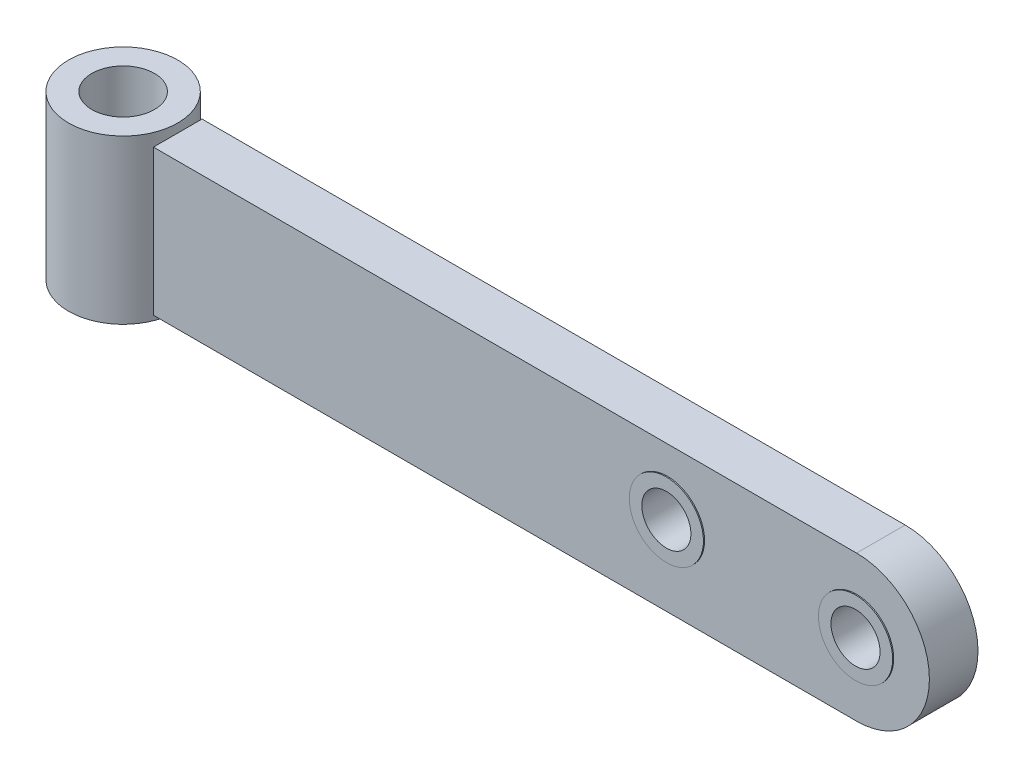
ISO-10303-21;
HEADER;
FILE_DESCRIPTION(('STEP AP214'),'2;1');
FILE_NAME('part.step','',(''),(''),'','','');
FILE_SCHEMA(('AUTOMOTIVE_DESIGN { 1 0 10303 214 1 1 1 1 }'));
ENDSEC;
DATA;
#1=APPLICATION_CONTEXT('core data for automotive mechanical design processes');
#2=APPLICATION_PROTOCOL_DEFINITION('international standard','automotive_design',2000,#1);
#3=PRODUCT_CONTEXT('',#1,'mechanical');
#4=PRODUCT('Part','Part','',(#3));
#5=PRODUCT_RELATED_PRODUCT_CATEGORY('part','',(#4));
#6=PRODUCT_DEFINITION_FORMATION('','',#4);
#7=PRODUCT_DEFINITION_CONTEXT('part definition',#1,'design');
#8=PRODUCT_DEFINITION('design','',#6,#7);
#9=PRODUCT_DEFINITION_SHAPE('','',#8);
#10=(LENGTH_UNIT() NAMED_UNIT(*) SI_UNIT(.MILLI.,.METRE.));
#11=(NAMED_UNIT(*) PLANE_ANGLE_UNIT() SI_UNIT($,.RADIAN.));
#12=(NAMED_UNIT(*) SI_UNIT($,.STERADIAN.) SOLID_ANGLE_UNIT());
#13=UNCERTAINTY_MEASURE_WITH_UNIT(LENGTH_MEASURE(1.E-05),#10,'distance_accuracy_value','');
#14=(GEOMETRIC_REPRESENTATION_CONTEXT(3) GLOBAL_UNCERTAINTY_ASSIGNED_CONTEXT((#13)) GLOBAL_UNIT_ASSIGNED_CONTEXT((#10,
#11,#12)) REPRESENTATION_CONTEXT('',''));
#15=CARTESIAN_POINT('',(0.,0.,0.));
#16=DIRECTION('',(0.,0.,1.));
#17=DIRECTION('',(1.,0.,0.));
#18=AXIS2_PLACEMENT_3D('',#15,#16,#17);
#19=CARTESIAN_POINT('',(369.402260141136,197.403156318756,-11.9813300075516));
#20=DIRECTION('',(0.,0.,-1.));
#21=DIRECTION('',(-1.,0.,0.));
#22=AXIS2_PLACEMENT_3D('',#19,#20,#21);
#23=CYLINDRICAL_SURFACE('',#22,3.2125);
#24=CARTESIAN_POINT('',(369.402260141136,197.403156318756,3.31999999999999));
#25=DIRECTION('',(0.,0.,-1.));
#26=DIRECTION('',(-1.,0.,0.));
#27=AXIS2_PLACEMENT_3D('',#24,#25,#26);
#28=CIRCLE('',#27,3.2125);
#29=CARTESIAN_POINT('',(366.189760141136,197.403156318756,3.31999999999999));
#30=VERTEX_POINT('',#29);
#31=EDGE_CURVE('P0_E27',#30,#30,#28,.T.);
#32=ORIENTED_EDGE('',*,*,#31,.F.);
#33=EDGE_LOOP('',(#32));
#34=FACE_BOUND('',#33,.T.);
#35=CARTESIAN_POINT('',(369.402260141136,197.403156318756,-3.43000000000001));
#36=DIRECTION('',(0.,0.,-1.));
#37=DIRECTION('',(-1.,0.,0.));
#38=AXIS2_PLACEMENT_3D('',#35,#36,#37);
#39=CIRCLE('',#38,3.2125);
#40=CARTESIAN_POINT('',(366.189760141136,197.403156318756,-3.43000000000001));
#41=VERTEX_POINT('',#40);
#42=EDGE_CURVE('P0_E18',#41,#41,#39,.T.);
#43=ORIENTED_EDGE('',*,*,#42,.T.);
#44=EDGE_LOOP('',(#43));
#45=FACE_BOUND('',#44,.T.);
#46=ADVANCED_FACE('P0_F15',(#34,#45),#23,.F.);
#47=CARTESIAN_POINT('',(369.843623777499,197.403156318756,-3.43000000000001));
#48=DIRECTION('',(0.,0.,1.));
#49=DIRECTION('',(1.,0.,0.));
#50=AXIS2_PLACEMENT_3D('',#47,#48,#49);
#51=PLANE('',#50);
#52=CARTESIAN_POINT('',(369.402260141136,197.403156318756,-3.43000000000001));
#53=DIRECTION('',(0.,0.,1.));
#54=DIRECTION('',(1.,0.,0.));
#55=AXIS2_PLACEMENT_3D('',#52,#53,#54);
#56=CIRCLE('',#55,4.855);
#57=CARTESIAN_POINT('',(374.257260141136,197.403156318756,-3.43000000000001));
#58=VERTEX_POINT('',#57);
#59=EDGE_CURVE('P0_E22',#58,#58,#56,.T.);
#60=ORIENTED_EDGE('',*,*,#59,.F.);
#61=EDGE_LOOP('',(#60));
#62=FACE_BOUND('',#61,.T.);
#63=ORIENTED_EDGE('',*,*,#42,.F.);
#64=EDGE_LOOP('',(#63));
#65=FACE_BOUND('',#64,.T.);
#66=ADVANCED_FACE('P0_F36',(#62,#65),#51,.F.);
#67=CARTESIAN_POINT('',(376.652260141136,197.403156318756,3.31999999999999));
#68=DIRECTION('',(0.,0.,1.));
#69=DIRECTION('',(1.,0.,0.));
#70=AXIS2_PLACEMENT_3D('',#67,#68,#69);
#71=PLANE('',#70);
#72=CARTESIAN_POINT('',(369.402260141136,197.403156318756,3.31999999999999));
#73=DIRECTION('',(0.,0.,1.));
#74=DIRECTION('',(1.,0.,0.));
#75=AXIS2_PLACEMENT_3D('',#72,#73,#74);
#76=CIRCLE('',#75,4.855);
#77=CARTESIAN_POINT('',(374.257260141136,197.403156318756,3.31999999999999));
#78=VERTEX_POINT('',#77);
#79=EDGE_CURVE('P0_E10',#78,#78,#76,.F.);
#80=ORIENTED_EDGE('',*,*,#79,.F.);
#81=EDGE_LOOP('',(#80));
#82=FACE_BOUND('',#81,.T.);
#83=ORIENTED_EDGE('',*,*,#31,.T.);
#84=EDGE_LOOP('',(#83));
#85=FACE_BOUND('',#84,.T.);
#86=ADVANCED_FACE('P0_F38',(#82,#85),#71,.T.);
#87=CARTESIAN_POINT('',(369.402260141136,197.403156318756,-3.43000000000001));
#88=DIRECTION('',(0.,0.,1.));
#89=DIRECTION('',(1.,0.,0.));
#90=AXIS2_PLACEMENT_3D('',#87,#88,#89);
#91=CYLINDRICAL_SURFACE('',#90,4.855);
#92=ORIENTED_EDGE('',*,*,#59,.T.);
#93=EDGE_LOOP('',(#92));
#94=FACE_BOUND('',#93,.T.);
#95=ORIENTED_EDGE('',*,*,#79,.T.);
#96=EDGE_LOOP('',(#95));
#97=FACE_BOUND('',#96,.T.);
#98=ADVANCED_FACE('P0_F45',(#94,#97),#91,.T.);
#99=CLOSED_SHELL('',(#46,#66,#86,#98));
#100=MANIFOLD_SOLID_BREP('P0_B1',#99);
#101=CARTESIAN_POINT('',(394.152260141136,196.403156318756,-11.9813300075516));
#102=DIRECTION('',(0.,0.,-1.));
#103=DIRECTION('',(-1.,0.,0.));
#104=AXIS2_PLACEMENT_3D('',#101,#102,#103);
#105=CYLINDRICAL_SURFACE('',#104,3.2125);
#106=CARTESIAN_POINT('',(394.152260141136,196.403156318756,3.31999999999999));
#107=DIRECTION('',(0.,0.,-1.));
#108=DIRECTION('',(-1.,0.,0.));
#109=AXIS2_PLACEMENT_3D('',#106,#107,#108);
#110=CIRCLE('',#109,3.2125);
#111=CARTESIAN_POINT('',(390.939760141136,196.403156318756,3.31999999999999));
#112=VERTEX_POINT('',#111);
#113=EDGE_CURVE('P1_E27',#112,#112,#110,.T.);
#114=ORIENTED_EDGE('',*,*,#113,.F.);
#115=EDGE_LOOP('',(#114));
#116=FACE_BOUND('',#115,.T.);
#117=CARTESIAN_POINT('',(394.152260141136,196.403156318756,-3.43000000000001));
#118=DIRECTION('',(0.,0.,-1.));
#119=DIRECTION('',(-1.,0.,0.));
#120=AXIS2_PLACEMENT_3D('',#117,#118,#119);
#121=CIRCLE('',#120,3.2125);
#122=CARTESIAN_POINT('',(390.939760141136,196.403156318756,-3.43000000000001));
#123=VERTEX_POINT('',#122);
#124=EDGE_CURVE('P1_E18',#123,#123,#121,.T.);
#125=ORIENTED_EDGE('',*,*,#124,.T.);
#126=EDGE_LOOP('',(#125));
#127=FACE_BOUND('',#126,.T.);
#128=ADVANCED_FACE('P1_F15',(#116,#127),#105,.F.);
#129=CARTESIAN_POINT('',(394.593623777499,196.403156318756,-3.43000000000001));
#130=DIRECTION('',(0.,0.,1.));
#131=DIRECTION('',(1.,0.,0.));
#132=AXIS2_PLACEMENT_3D('',#129,#130,#131);
#133=PLANE('',#132);
#134=CARTESIAN_POINT('',(394.152260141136,196.403156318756,-3.43000000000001));
#135=DIRECTION('',(0.,0.,1.));
#136=DIRECTION('',(1.,0.,0.));
#137=AXIS2_PLACEMENT_3D('',#134,#135,#136);
#138=CIRCLE('',#137,4.855);
#139=CARTESIAN_POINT('',(399.007260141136,196.403156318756,-3.43000000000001));
#140=VERTEX_POINT('',#139);
#141=EDGE_CURVE('P1_E22',#140,#140,#138,.T.);
#142=ORIENTED_EDGE('',*,*,#141,.F.);
#143=EDGE_LOOP('',(#142));
#144=FACE_BOUND('',#143,.T.);
#145=ORIENTED_EDGE('',*,*,#124,.F.);
#146=EDGE_LOOP('',(#145));
#147=FACE_BOUND('',#146,.T.);
#148=ADVANCED_FACE('P1_F36',(#144,#147),#133,.F.);
#149=CARTESIAN_POINT('',(401.402260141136,196.403156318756,3.31999999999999));
#150=DIRECTION('',(0.,0.,1.));
#151=DIRECTION('',(1.,0.,0.));
#152=AXIS2_PLACEMENT_3D('',#149,#150,#151);
#153=PLANE('',#152);
#154=CARTESIAN_POINT('',(394.152260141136,196.403156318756,3.31999999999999));
#155=DIRECTION('',(0.,0.,1.));
#156=DIRECTION('',(1.,0.,0.));
#157=AXIS2_PLACEMENT_3D('',#154,#155,#156);
#158=CIRCLE('',#157,4.855);
#159=CARTESIAN_POINT('',(399.007260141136,196.403156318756,3.31999999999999));
#160=VERTEX_POINT('',#159);
#161=EDGE_CURVE('P1_E10',#160,#160,#158,.F.);
#162=ORIENTED_EDGE('',*,*,#161,.F.);
#163=EDGE_LOOP('',(#162));
#164=FACE_BOUND('',#163,.T.);
#165=ORIENTED_EDGE('',*,*,#113,.T.);
#166=EDGE_LOOP('',(#165));
#167=FACE_BOUND('',#166,.T.);
#168=ADVANCED_FACE('P1_F38',(#164,#167),#153,.T.);
#169=CARTESIAN_POINT('',(394.152260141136,196.403156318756,-3.43000000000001));
#170=DIRECTION('',(0.,0.,1.));
#171=DIRECTION('',(1.,0.,0.));
#172=AXIS2_PLACEMENT_3D('',#169,#170,#171);
#173=CYLINDRICAL_SURFACE('',#172,4.855);
#174=ORIENTED_EDGE('',*,*,#141,.T.);
#175=EDGE_LOOP('',(#174));
#176=FACE_BOUND('',#175,.T.);
#177=ORIENTED_EDGE('',*,*,#161,.T.);
#178=EDGE_LOOP('',(#177));
#179=FACE_BOUND('',#178,.T.);
#180=ADVANCED_FACE('P1_F45',(#176,#179),#173,.T.);
#181=CLOSED_SHELL('',(#128,#148,#168,#180));
#182=MANIFOLD_SOLID_BREP('P1_B1',#181);
#183=CARTESIAN_POINT('',(295.008260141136,177.682466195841,0.));
#184=DIRECTION('',(0.,-1.,0.));
#185=DIRECTION('',(0.,0.,-1.));
#186=AXIS2_PLACEMENT_3D('',#183,#184,#185);
#187=CYLINDRICAL_SURFACE('',#186,4.1);
#188=CARTESIAN_POINT('',(295.008260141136,207.068156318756,0.));
#189=DIRECTION('',(0.,-1.,0.));
#190=DIRECTION('',(0.,0.,-1.));
#191=AXIS2_PLACEMENT_3D('',#188,#189,#190);
#192=CIRCLE('',#191,4.1);
#193=CARTESIAN_POINT('',(295.008260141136,207.068156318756,-4.09999999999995));
#194=VERTEX_POINT('',#193);
#195=EDGE_CURVE('P2_E26',#194,#194,#192,.T.);
#196=ORIENTED_EDGE('',*,*,#195,.F.);
#197=EDGE_LOOP('',(#196));
#198=FACE_BOUND('',#197,.T.);
#199=CARTESIAN_POINT('',(295.008260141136,185.732156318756,0.));
#200=DIRECTION('',(0.,-1.,0.));
#201=DIRECTION('',(0.,0.,-1.));
#202=AXIS2_PLACEMENT_3D('',#199,#200,#201);
#203=CIRCLE('',#202,4.1);
#204=CARTESIAN_POINT('',(295.008260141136,185.732156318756,-4.09999999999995));
#205=VERTEX_POINT('',#204);
#206=EDGE_CURVE('P2_E17',#205,#205,#203,.F.);
#207=ORIENTED_EDGE('',*,*,#206,.F.);
#208=EDGE_LOOP('',(#207));
#209=FACE_BOUND('',#208,.T.);
#210=ADVANCED_FACE('P2_F14',(#198,#209),#187,.F.);
#211=CARTESIAN_POINT('',(295.008260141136,185.732156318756,-3.57199999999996));
#212=DIRECTION('',(0.,-1.,0.));
#213=DIRECTION('',(0.,0.,-1.));
#214=AXIS2_PLACEMENT_3D('',#211,#212,#213);
#215=PLANE('',#214);
#216=CARTESIAN_POINT('',(295.008260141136,185.732156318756,0.));
#217=DIRECTION('',(0.,1.,0.));
#218=DIRECTION('',(0.,0.,1.));
#219=AXIS2_PLACEMENT_3D('',#216,#217,#218);
#220=CIRCLE('',#219,7.14400000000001);
#221=CARTESIAN_POINT('',(295.008260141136,185.732156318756,7.14400000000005));
#222=VERTEX_POINT('',#221);
#223=EDGE_CURVE('P2_E21',#222,#222,#220,.T.);
#224=ORIENTED_EDGE('',*,*,#223,.F.);
#225=EDGE_LOOP('',(#224));
#226=FACE_BOUND('',#225,.T.);
#227=ORIENTED_EDGE('',*,*,#206,.T.);
#228=EDGE_LOOP('',(#227));
#229=FACE_BOUND('',#228,.T.);
#230=ADVANCED_FACE('P2_F34',(#226,#229),#215,.T.);
#231=CARTESIAN_POINT('',(295.008260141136,207.068156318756,-3.57199999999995));
#232=DIRECTION('',(0.,1.,0.));
#233=DIRECTION('',(0.,0.,1.));
#234=AXIS2_PLACEMENT_3D('',#231,#232,#233);
#235=PLANE('',#234);
#236=CARTESIAN_POINT('',(295.008260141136,207.068156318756,0.));
#237=DIRECTION('',(0.,1.,0.));
#238=DIRECTION('',(0.,0.,1.));
#239=AXIS2_PLACEMENT_3D('',#236,#237,#238);
#240=CIRCLE('',#239,7.14400000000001);
#241=CARTESIAN_POINT('',(295.008260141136,207.068156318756,7.14400000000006));
#242=VERTEX_POINT('',#241);
#243=EDGE_CURVE('P2_E9',#242,#242,#240,.F.);
#244=ORIENTED_EDGE('',*,*,#243,.F.);
#245=EDGE_LOOP('',(#244));
#246=FACE_BOUND('',#245,.T.);
#247=ORIENTED_EDGE('',*,*,#195,.T.);
#248=EDGE_LOOP('',(#247));
#249=FACE_BOUND('',#248,.T.);
#250=ADVANCED_FACE('P2_F42',(#246,#249),#235,.T.);
#251=CARTESIAN_POINT('',(295.008260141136,196.400156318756,0.));
#252=DIRECTION('',(0.,1.,0.));
#253=DIRECTION('',(0.,0.,1.));
#254=AXIS2_PLACEMENT_3D('',#251,#252,#253);
#255=CYLINDRICAL_SURFACE('',#254,7.14400000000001);
#256=ORIENTED_EDGE('',*,*,#223,.T.);
#257=EDGE_LOOP('',(#256));
#258=FACE_BOUND('',#257,.T.);
#259=ORIENTED_EDGE('',*,*,#243,.T.);
#260=EDGE_LOOP('',(#259));
#261=FACE_BOUND('',#260,.T.);
#262=ADVANCED_FACE('P2_F44',(#258,#261),#255,.T.);
#263=CLOSED_SHELL('',(#210,#230,#250,#262));
#264=MANIFOLD_SOLID_BREP('P2_B1',#263);
#265=CARTESIAN_POINT('',(351.001447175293,196.403156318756,3.18));
#266=DIRECTION('',(0.,0.,1.));
#267=DIRECTION('',(0.,-1.,0.));
#268=AXIS2_PLACEMENT_3D('',#265,#266,#267);
#269=PLANE('',#268);
#270=DIRECTION('',(1.,0.,0.));
#271=VECTOR('',#270,1.);
#272=CARTESIAN_POINT('',(302.152260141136,205.928156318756,3.18));
#273=LINE('',#272,#271);
#274=CARTESIAN_POINT('',(302.152260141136,205.928156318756,3.18));
#275=VERTEX_POINT('',#274);
#276=CARTESIAN_POINT('',(394.152260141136,205.928156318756,3.18));
#277=VERTEX_POINT('',#276);
#278=EDGE_CURVE('P3_E51',#275,#277,#273,.T.);
#279=ORIENTED_EDGE('',*,*,#278,.F.);
#280=DIRECTION('',(0.,1.,0.));
#281=VECTOR('',#280,1.);
#282=CARTESIAN_POINT('',(302.152260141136,186.878156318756,3.18));
#283=LINE('',#282,#281);
#284=CARTESIAN_POINT('',(302.152260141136,186.878156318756,3.18));
#285=VERTEX_POINT('',#284);
#286=EDGE_CURVE('P3_E68',#285,#275,#283,.T.);
#287=ORIENTED_EDGE('',*,*,#286,.F.);
#288=DIRECTION('',(1.,0.,0.));
#289=VECTOR('',#288,1.);
#290=CARTESIAN_POINT('',(394.152260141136,186.878156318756,3.18));
#291=LINE('',#290,#289);
#292=CARTESIAN_POINT('',(394.152260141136,186.878156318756,3.18));
#293=VERTEX_POINT('',#292);
#294=EDGE_CURVE('P3_E56',#293,#285,#291,.F.);
#295=ORIENTED_EDGE('',*,*,#294,.F.);
#296=CARTESIAN_POINT('',(394.152260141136,196.403156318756,3.18));
#297=DIRECTION('',(0.,0.,1.));
#298=DIRECTION('',(1.,0.,0.));
#299=AXIS2_PLACEMENT_3D('',#296,#297,#298);
#300=CIRCLE('',#299,9.525);
#301=EDGE_CURVE('P3_E88',#277,#293,#300,.F.);
#302=ORIENTED_EDGE('',*,*,#301,.F.);
#303=EDGE_LOOP('',(#279,#287,#295,#302));
#304=FACE_BOUND('',#303,.T.);
#305=CARTESIAN_POINT('',(394.152260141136,196.403156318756,3.18));
#306=DIRECTION('',(0.,0.,-1.));
#307=DIRECTION('',(0.,1.,0.));
#308=AXIS2_PLACEMENT_3D('',#305,#306,#307);
#309=CIRCLE('',#308,4.755);
#310=CARTESIAN_POINT('',(394.152260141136,201.158156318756,3.18));
#311=VERTEX_POINT('',#310);
#312=EDGE_CURVE('P3_E93',#311,#311,#309,.T.);
#313=ORIENTED_EDGE('',*,*,#312,.T.);
#314=EDGE_LOOP('',(#313));
#315=FACE_BOUND('',#314,.T.);
#316=CARTESIAN_POINT('',(369.402260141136,197.403156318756,3.18));
#317=DIRECTION('',(0.,0.,-1.));
#318=DIRECTION('',(0.,1.,0.));
#319=AXIS2_PLACEMENT_3D('',#316,#317,#318);
#320=CIRCLE('',#319,4.755);
#321=CARTESIAN_POINT('',(369.402260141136,202.158156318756,3.18));
#322=VERTEX_POINT('',#321);
#323=EDGE_CURVE('P3_E19',#322,#322,#320,.T.);
#324=ORIENTED_EDGE('',*,*,#323,.T.);
#325=EDGE_LOOP('',(#324));
#326=FACE_BOUND('',#325,.T.);
#327=ADVANCED_FACE('P3_F16',(#304,#315,#326),#269,.T.);
#328=CARTESIAN_POINT('',(369.402260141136,197.403156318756,-100.312404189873));
#329=DIRECTION('',(0.,0.,-1.));
#330=DIRECTION('',(0.,1.,0.));
#331=AXIS2_PLACEMENT_3D('',#328,#329,#330);
#332=CYLINDRICAL_SURFACE('',#331,4.755);
#333=CARTESIAN_POINT('',(369.402260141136,197.403156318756,-3.18));
#334=DIRECTION('',(0.,0.,-1.));
#335=DIRECTION('',(0.,1.,0.));
#336=AXIS2_PLACEMENT_3D('',#333,#334,#335);
#337=CIRCLE('',#336,4.755);
#338=CARTESIAN_POINT('',(369.402260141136,202.158156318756,-3.18));
#339=VERTEX_POINT('',#338);
#340=EDGE_CURVE('P3_E83',#339,#339,#337,.T.);
#341=ORIENTED_EDGE('',*,*,#340,.T.);
#342=EDGE_LOOP('',(#341));
#343=FACE_BOUND('',#342,.T.);
#344=ORIENTED_EDGE('',*,*,#323,.F.);
#345=EDGE_LOOP('',(#344));
#346=FACE_BOUND('',#345,.T.);
#347=ADVANCED_FACE('P3_F105',(#343,#346),#332,.F.);
#348=CARTESIAN_POINT('',(394.152260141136,196.403156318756,-100.312404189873));
#349=DIRECTION('',(0.,0.,-1.));
#350=DIRECTION('',(0.,1.,0.));
#351=AXIS2_PLACEMENT_3D('',#348,#349,#350);
#352=CYLINDRICAL_SURFACE('',#351,4.755);
#353=CARTESIAN_POINT('',(394.152260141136,196.403156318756,-3.18));
#354=DIRECTION('',(0.,0.,-1.));
#355=DIRECTION('',(0.,1.,0.));
#356=AXIS2_PLACEMENT_3D('',#353,#354,#355);
#357=CIRCLE('',#356,4.755);
#358=CARTESIAN_POINT('',(394.152260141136,201.158156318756,-3.18));
#359=VERTEX_POINT('',#358);
#360=EDGE_CURVE('P3_E80',#359,#359,#357,.T.);
#361=ORIENTED_EDGE('',*,*,#360,.T.);
#362=EDGE_LOOP('',(#361));
#363=FACE_BOUND('',#362,.T.);
#364=ORIENTED_EDGE('',*,*,#312,.F.);
#365=EDGE_LOOP('',(#364));
#366=FACE_BOUND('',#365,.T.);
#367=ADVANCED_FACE('P3_F107',(#363,#366),#352,.F.);
#368=CARTESIAN_POINT('',(302.152260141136,205.928156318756,-3.18));
#369=DIRECTION('',(0.,1.,0.));
#370=DIRECTION('',(0.,0.,1.));
#371=AXIS2_PLACEMENT_3D('',#368,#369,#370);
#372=PLANE('',#371);
#373=DIRECTION('',(1.,0.,0.));
#374=VECTOR('',#373,1.);
#375=CARTESIAN_POINT('',(351.001447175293,205.928156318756,-3.18));
#376=LINE('',#375,#374);
#377=CARTESIAN_POINT('',(394.152260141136,205.928156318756,-3.18));
#378=VERTEX_POINT('',#377);
#379=CARTESIAN_POINT('',(302.152260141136,205.928156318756,-3.18));
#380=VERTEX_POINT('',#379);
#381=EDGE_CURVE('P3_E75',#378,#380,#376,.F.);
#382=ORIENTED_EDGE('',*,*,#381,.T.);
#383=DIRECTION('',(0.,0.,1.));
#384=VECTOR('',#383,1.);
#385=CARTESIAN_POINT('',(302.152260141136,205.928156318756,-3.18));
#386=LINE('',#385,#384);
#387=EDGE_CURVE('P3_E63',#275,#380,#386,.F.);
#388=ORIENTED_EDGE('',*,*,#387,.F.);
#389=ORIENTED_EDGE('',*,*,#278,.T.);
#390=DIRECTION('',(0.,0.,1.));
#391=VECTOR('',#390,1.);
#392=CARTESIAN_POINT('',(394.152260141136,205.928156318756,-3.18));
#393=LINE('',#392,#391);
#394=EDGE_CURVE('P3_E79',#378,#277,#393,.T.);
#395=ORIENTED_EDGE('',*,*,#394,.F.);
#396=EDGE_LOOP('',(#382,#388,#389,#395));
#397=FACE_BOUND('',#396,.T.);
#398=ADVANCED_FACE('P3_F78',(#397),#372,.T.);
#399=CARTESIAN_POINT('',(302.152260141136,186.878156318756,-3.18));
#400=DIRECTION('',(-1.,0.,0.));
#401=DIRECTION('',(0.,0.,1.));
#402=AXIS2_PLACEMENT_3D('',#399,#400,#401);
#403=PLANE('',#402);
#404=DIRECTION('',(0.,-1.,0.));
#405=VECTOR('',#404,1.);
#406=CARTESIAN_POINT('',(302.152260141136,196.403156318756,-3.18));
#407=LINE('',#406,#405);
#408=CARTESIAN_POINT('',(302.152260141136,186.878156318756,-3.18));
#409=VERTEX_POINT('',#408);
#410=EDGE_CURVE('P3_E67',#380,#409,#407,.T.);
#411=ORIENTED_EDGE('',*,*,#410,.T.);
#412=DIRECTION('',(0.,0.,1.));
#413=VECTOR('',#412,1.);
#414=CARTESIAN_POINT('',(302.152260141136,186.878156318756,-3.18));
#415=LINE('',#414,#413);
#416=EDGE_CURVE('P3_E90',#285,#409,#415,.F.);
#417=ORIENTED_EDGE('',*,*,#416,.F.);
#418=ORIENTED_EDGE('',*,*,#286,.T.);
#419=ORIENTED_EDGE('',*,*,#387,.T.);
#420=EDGE_LOOP('',(#411,#417,#418,#419));
#421=FACE_BOUND('',#420,.T.);
#422=ADVANCED_FACE('P3_F65',(#421),#403,.T.);
#423=CARTESIAN_POINT('',(394.152260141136,186.878156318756,-3.18));
#424=DIRECTION('',(0.,-1.,0.));
#425=DIRECTION('',(1.,0.,0.));
#426=AXIS2_PLACEMENT_3D('',#423,#424,#425);
#427=PLANE('',#426);
#428=DIRECTION('',(1.,0.,0.));
#429=VECTOR('',#428,1.);
#430=CARTESIAN_POINT('',(351.001447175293,186.878156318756,-3.18));
#431=LINE('',#430,#429);
#432=CARTESIAN_POINT('',(394.152260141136,186.878156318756,-3.18));
#433=VERTEX_POINT('',#432);
#434=EDGE_CURVE('P3_E25',#409,#433,#431,.T.);
#435=ORIENTED_EDGE('',*,*,#434,.T.);
#436=DIRECTION('',(0.,0.,1.));
#437=VECTOR('',#436,1.);
#438=CARTESIAN_POINT('',(394.152260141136,186.878156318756,-3.18));
#439=LINE('',#438,#437);
#440=EDGE_CURVE('P3_E33',#293,#433,#439,.F.);
#441=ORIENTED_EDGE('',*,*,#440,.F.);
#442=ORIENTED_EDGE('',*,*,#294,.T.);
#443=ORIENTED_EDGE('',*,*,#416,.T.);
#444=EDGE_LOOP('',(#435,#441,#442,#443));
#445=FACE_BOUND('',#444,.T.);
#446=ADVANCED_FACE('P3_F123',(#445),#427,.T.);
#447=CARTESIAN_POINT('',(394.152260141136,196.403156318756,-3.18));
#448=DIRECTION('',(0.,0.,1.));
#449=DIRECTION('',(1.,0.,0.));
#450=AXIS2_PLACEMENT_3D('',#447,#448,#449);
#451=CYLINDRICAL_SURFACE('',#450,9.525);
#452=CARTESIAN_POINT('',(394.152260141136,196.403156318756,-3.18));
#453=DIRECTION('',(0.,0.,1.));
#454=DIRECTION('',(1.,0.,0.));
#455=AXIS2_PLACEMENT_3D('',#452,#453,#454);
#456=CIRCLE('',#455,9.525);
#457=EDGE_CURVE('P3_E10',#433,#378,#456,.T.);
#458=ORIENTED_EDGE('',*,*,#457,.T.);
#459=ORIENTED_EDGE('',*,*,#394,.T.);
#460=ORIENTED_EDGE('',*,*,#301,.T.);
#461=ORIENTED_EDGE('',*,*,#440,.T.);
#462=EDGE_LOOP('',(#458,#459,#460,#461));
#463=FACE_BOUND('',#462,.T.);
#464=ADVANCED_FACE('P3_F118',(#463),#451,.T.);
#465=CARTESIAN_POINT('',(351.001447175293,196.403156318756,-3.18));
#466=DIRECTION('',(0.,0.,1.));
#467=DIRECTION('',(0.,-1.,0.));
#468=AXIS2_PLACEMENT_3D('',#465,#466,#467);
#469=PLANE('',#468);
#470=ORIENTED_EDGE('',*,*,#434,.F.);
#471=ORIENTED_EDGE('',*,*,#410,.F.);
#472=ORIENTED_EDGE('',*,*,#381,.F.);
#473=ORIENTED_EDGE('',*,*,#457,.F.);
#474=EDGE_LOOP('',(#470,#471,#472,#473));
#475=FACE_BOUND('',#474,.T.);
#476=ORIENTED_EDGE('',*,*,#360,.F.);
#477=EDGE_LOOP('',(#476));
#478=FACE_BOUND('',#477,.T.);
#479=ORIENTED_EDGE('',*,*,#340,.F.);
#480=EDGE_LOOP('',(#479));
#481=FACE_BOUND('',#480,.T.);
#482=ADVANCED_FACE('P3_F73',(#475,#478,#481),#469,.F.);
#483=CLOSED_SHELL('',(#327,#347,#367,#398,#422,#446,#464,#482));
#484=MANIFOLD_SOLID_BREP('P3_B1',#483);
#485=ADVANCED_BREP_SHAPE_REPRESENTATION('',(#18,#100,#182,#264,#484),#14);
#486=SHAPE_DEFINITION_REPRESENTATION(#9,#485);
ENDSEC;
END-ISO-10303-21;
